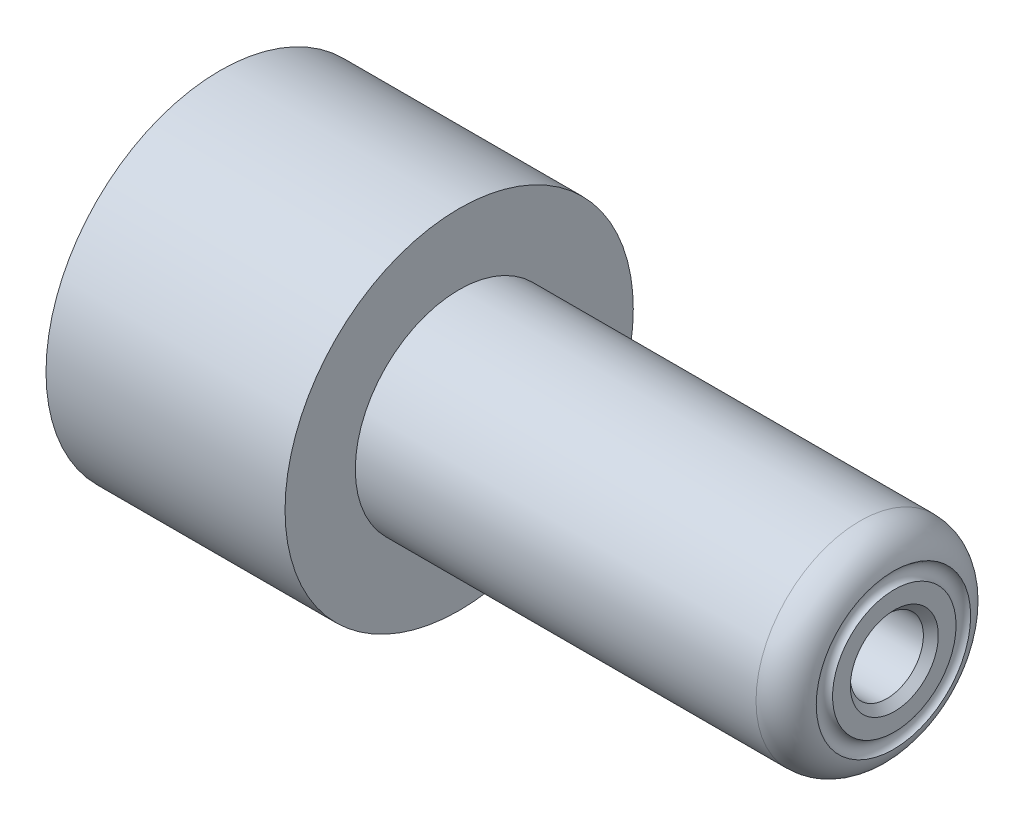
from build123d import *

# Parameters (mm, degrees)
SKETCH2_R          = 1.18
CUT_EXTRUDE1_DEPTH = 2.36
SKETCH3_R          = 1.665
CUT_EXTRUDE2_DEPTH = 33.7198192
CHAMFER1_SIZE      = 0.34
SKETCH4_R          = 0.381


with BuildPart() as part:
    # Sketch1 → Revolve1 (revolve)
    with BuildSketch(Plane.XY, mode=Mode.PRIVATE) as revolve1_sk:
        with BuildLine():
            Line((0, 3.57), (0, 7.9375))
            Line((0, 7.9375), (10.8966, 7.9375))
            Line((10.8966, 7.9375), (10.8966, 4.735))
            Line((10.8966, 4.735), (29.164, 4.735))
            ThreePointArc((29.164, 4.735), (30.274157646, 4.275157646), (30.734, 3.165))
            Line((30.734, 3.165), (30.734, 0))
            Line((30.734, 0), (24.4856, 0))
            Line((24.4856, 0), (24.4856, 3.57))
            Line((24.4856, 3.57), (0, 3.57))
        make_face()
    revolve(revolve1_sk.sketch.rotate(Axis((0, 0, 0), (1, 0, 0)), 90), axis=Axis((0, 0, 0), (1, 0, 0)))

    # Sketch2 → Cut-Extrude1 (cut)
    with BuildSketch(Plane.ZY):
        with Locations((-5.5499, 0)):
            Circle(SKETCH2_R)
        with Locations(Location((5.5499, 0, 0), (0, 0, 180))):
            Circle(SKETCH2_R)
    extrude(amount=-CUT_EXTRUDE1_DEPTH, mode=Mode.SUBTRACT)

    # Sketch3 → Cut-Extrude2 (cut, through all)
    with BuildSketch(Plane(origin=(30.734, 0, 0), x_dir=(0, 0, -1), z_dir=(1, 0, 0))):
        Circle(SKETCH3_R)
    extrude(amount=-CUT_EXTRUDE2_DEPTH, mode=Mode.SUBTRACT)

    # Chamfer1
    chamfer1_edges = [part.edges().sort_by_distance(p)[0] for p in [
        (30.734, 0, 1.665),
    ]]
    chamfer(chamfer1_edges, length=CHAMFER1_SIZE)

    # Sketch4 → Cut-Revolve1 (revolve, cut)
    with BuildSketch(Plane.XY, mode=Mode.PRIVATE) as cut_revolve1_sk:
        with Locations((30.857, 3.175)):
            Circle(SKETCH4_R)
    revolve(cut_revolve1_sk.sketch.rotate(Axis((0, 0, 0), (1, 0, 0)), 90), axis=Axis((0, 0, 0), (1, 0, 0)), mode=Mode.SUBTRACT)


solid = part.part
